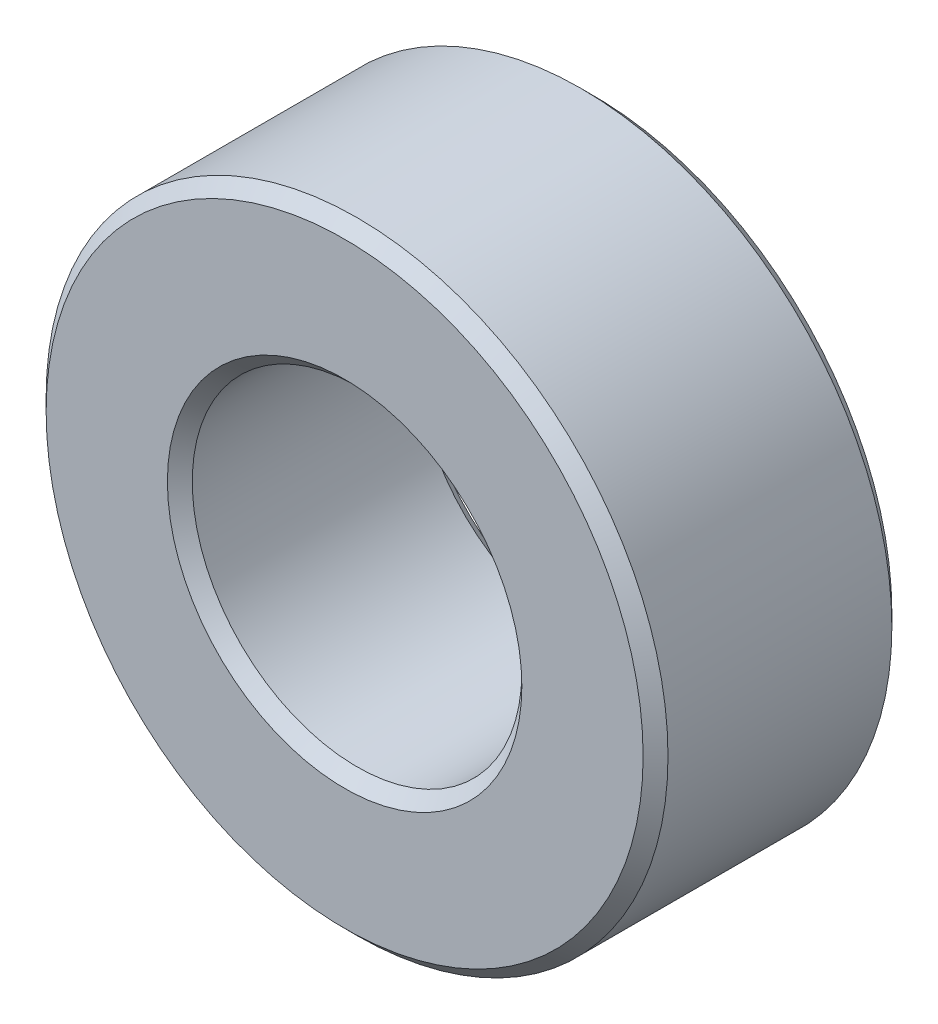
ISO-10303-21;
HEADER;
FILE_DESCRIPTION(('STEP AP214'),'2;1');
FILE_NAME('part.step','',(''),(''),'','','');
FILE_SCHEMA(('AUTOMOTIVE_DESIGN { 1 0 10303 214 1 1 1 1 }'));
ENDSEC;
DATA;
#1=APPLICATION_CONTEXT('core data for automotive mechanical design processes');
#2=APPLICATION_PROTOCOL_DEFINITION('international standard','automotive_design',2000,#1);
#3=PRODUCT_CONTEXT('',#1,'mechanical');
#4=PRODUCT('Part','Part','',(#3));
#5=PRODUCT_RELATED_PRODUCT_CATEGORY('part','',(#4));
#6=PRODUCT_DEFINITION_FORMATION('','',#4);
#7=PRODUCT_DEFINITION_CONTEXT('part definition',#1,'design');
#8=PRODUCT_DEFINITION('design','',#6,#7);
#9=PRODUCT_DEFINITION_SHAPE('','',#8);
#10=(LENGTH_UNIT() NAMED_UNIT(*) SI_UNIT(.MILLI.,.METRE.));
#11=(NAMED_UNIT(*) PLANE_ANGLE_UNIT() SI_UNIT($,.RADIAN.));
#12=(NAMED_UNIT(*) SI_UNIT($,.STERADIAN.) SOLID_ANGLE_UNIT());
#13=UNCERTAINTY_MEASURE_WITH_UNIT(LENGTH_MEASURE(1.E-05),#10,'distance_accuracy_value','');
#14=(GEOMETRIC_REPRESENTATION_CONTEXT(3) GLOBAL_UNCERTAINTY_ASSIGNED_CONTEXT((#13)) GLOBAL_UNIT_ASSIGNED_CONTEXT((#10,
#11,#12)) REPRESENTATION_CONTEXT('',''));
#15=CARTESIAN_POINT('',(0.,0.,0.));
#16=DIRECTION('',(0.,0.,1.));
#17=DIRECTION('',(1.,0.,0.));
#18=AXIS2_PLACEMENT_3D('',#15,#16,#17);
#19=CARTESIAN_POINT('',(0.,0.,2.));
#20=DIRECTION('',(0.,0.,1.));
#21=DIRECTION('',(1.,0.,0.));
#22=AXIS2_PLACEMENT_3D('',#19,#20,#21);
#23=PLANE('',#22);
#24=CARTESIAN_POINT('',(0.,0.,2.));
#25=DIRECTION('',(0.,0.,1.));
#26=DIRECTION('',(1.,0.,0.));
#27=AXIS2_PLACEMENT_3D('',#24,#25,#26);
#28=CIRCLE('',#27,2.85);
#29=CARTESIAN_POINT('',(2.85,0.,2.));
#30=VERTEX_POINT('',#29);
#31=EDGE_CURVE('E10',#30,#30,#28,.F.);
#32=ORIENTED_EDGE('',*,*,#31,.T.);
#33=EDGE_LOOP('',(#32));
#34=FACE_BOUND('',#33,.T.);
#35=CARTESIAN_POINT('',(0.,0.,2.));
#36=DIRECTION('',(0.,0.,1.));
#37=DIRECTION('',(1.,0.,0.));
#38=AXIS2_PLACEMENT_3D('',#35,#36,#37);
#39=CIRCLE('',#38,4.8);
#40=CARTESIAN_POINT('',(4.8,0.,2.));
#41=VERTEX_POINT('',#40);
#42=EDGE_CURVE('E45',#41,#41,#39,.T.);
#43=ORIENTED_EDGE('',*,*,#42,.T.);
#44=EDGE_LOOP('',(#43));
#45=FACE_BOUND('',#44,.T.);
#46=ADVANCED_FACE('F37',(#34,#45),#23,.T.);
#47=CARTESIAN_POINT('',(0.,0.,-2.));
#48=DIRECTION('',(0.,0.,1.));
#49=DIRECTION('',(1.,0.,0.));
#50=AXIS2_PLACEMENT_3D('',#47,#48,#49);
#51=PLANE('',#50);
#52=CARTESIAN_POINT('',(0.,0.,-2.));
#53=DIRECTION('',(0.,0.,1.));
#54=DIRECTION('',(1.,0.,0.));
#55=AXIS2_PLACEMENT_3D('',#52,#53,#54);
#56=CIRCLE('',#55,4.8);
#57=CARTESIAN_POINT('',(4.8,0.,-2.));
#58=VERTEX_POINT('',#57);
#59=EDGE_CURVE('E63',#58,#58,#56,.F.);
#60=ORIENTED_EDGE('',*,*,#59,.T.);
#61=EDGE_LOOP('',(#60));
#62=FACE_BOUND('',#61,.T.);
#63=CARTESIAN_POINT('',(0.,0.,-2.));
#64=DIRECTION('',(0.,0.,1.));
#65=DIRECTION('',(1.,0.,0.));
#66=AXIS2_PLACEMENT_3D('',#63,#64,#65);
#67=CIRCLE('',#66,2.85);
#68=CARTESIAN_POINT('',(2.85,0.,-2.));
#69=VERTEX_POINT('',#68);
#70=EDGE_CURVE('E66',#69,#69,#67,.T.);
#71=ORIENTED_EDGE('',*,*,#70,.T.);
#72=EDGE_LOOP('',(#71));
#73=FACE_BOUND('',#72,.T.);
#74=ADVANCED_FACE('F89',(#62,#73),#51,.F.);
#75=CARTESIAN_POINT('',(0.,0.,2.));
#76=DIRECTION('',(0.,0.,-1.));
#77=DIRECTION('',(-1.,0.,0.));
#78=AXIS2_PLACEMENT_3D('',#75,#76,#77);
#79=CYLINDRICAL_SURFACE('',#78,5.);
#80=CARTESIAN_POINT('',(0.,0.,-1.8));
#81=DIRECTION('',(0.,0.,1.));
#82=DIRECTION('',(1.,0.,0.));
#83=AXIS2_PLACEMENT_3D('',#80,#81,#82);
#84=CIRCLE('',#83,5.);
#85=CARTESIAN_POINT('',(5.,0.,-1.8));
#86=VERTEX_POINT('',#85);
#87=EDGE_CURVE('E69',#86,#86,#84,.T.);
#88=ORIENTED_EDGE('',*,*,#87,.T.);
#89=EDGE_LOOP('',(#88));
#90=FACE_BOUND('',#89,.T.);
#91=CARTESIAN_POINT('',(0.,0.,1.8));
#92=DIRECTION('',(0.,0.,1.));
#93=DIRECTION('',(1.,0.,0.));
#94=AXIS2_PLACEMENT_3D('',#91,#92,#93);
#95=CIRCLE('',#94,5.);
#96=CARTESIAN_POINT('',(5.,0.,1.8));
#97=VERTEX_POINT('',#96);
#98=EDGE_CURVE('E73',#97,#97,#95,.F.);
#99=ORIENTED_EDGE('',*,*,#98,.T.);
#100=EDGE_LOOP('',(#99));
#101=FACE_BOUND('',#100,.T.);
#102=ADVANCED_FACE('F78',(#90,#101),#79,.T.);
#103=CARTESIAN_POINT('',(0.,0.,2.));
#104=DIRECTION('',(0.,0.,-1.));
#105=DIRECTION('',(-1.,0.,0.));
#106=AXIS2_PLACEMENT_3D('',#103,#104,#105);
#107=CYLINDRICAL_SURFACE('',#106,2.65);
#108=CARTESIAN_POINT('',(0.,0.,-1.8));
#109=DIRECTION('',(0.,0.,1.));
#110=DIRECTION('',(1.,0.,0.));
#111=AXIS2_PLACEMENT_3D('',#108,#109,#110);
#112=CIRCLE('',#111,2.65);
#113=CARTESIAN_POINT('',(2.65,0.,-1.8));
#114=VERTEX_POINT('',#113);
#115=EDGE_CURVE('E51',#114,#114,#112,.F.);
#116=ORIENTED_EDGE('',*,*,#115,.T.);
#117=EDGE_LOOP('',(#116));
#118=FACE_BOUND('',#117,.T.);
#119=CARTESIAN_POINT('',(0.,0.,1.8));
#120=DIRECTION('',(0.,0.,1.));
#121=DIRECTION('',(1.,0.,0.));
#122=AXIS2_PLACEMENT_3D('',#119,#120,#121);
#123=CIRCLE('',#122,2.65);
#124=CARTESIAN_POINT('',(2.65,0.,1.8));
#125=VERTEX_POINT('',#124);
#126=EDGE_CURVE('E57',#125,#125,#123,.T.);
#127=ORIENTED_EDGE('',*,*,#126,.T.);
#128=EDGE_LOOP('',(#127));
#129=FACE_BOUND('',#128,.T.);
#130=ADVANCED_FACE('F97',(#118,#129),#107,.F.);
#131=CARTESIAN_POINT('',(0.,0.,-1.8));
#132=DIRECTION('',(0.,0.,1.));
#133=DIRECTION('',(1.,0.,0.));
#134=AXIS2_PLACEMENT_3D('',#131,#132,#133);
#135=CONICAL_SURFACE('',#134,5.,0.785398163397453);
#136=CARTESIAN_POINT('',(4.8,0.,-2.));
#137=CARTESIAN_POINT('',(4.80208333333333,0.,-1.99791666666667));
#138=CARTESIAN_POINT('',(4.80416666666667,0.,-1.99583333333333));
#139=CARTESIAN_POINT('',(4.80833333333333,0.,-1.99166666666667));
#140=CARTESIAN_POINT('',(4.81041666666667,0.,-1.98958333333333));
#141=CARTESIAN_POINT('',(4.81458333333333,0.,-1.98541666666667));
#142=CARTESIAN_POINT('',(4.81666666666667,0.,-1.98333333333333));
#143=CARTESIAN_POINT('',(4.82083333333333,0.,-1.97916666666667));
#144=CARTESIAN_POINT('',(4.82291666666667,0.,-1.97708333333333));
#145=CARTESIAN_POINT('',(4.82708333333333,0.,-1.97291666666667));
#146=CARTESIAN_POINT('',(4.82916666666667,0.,-1.97083333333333));
#147=CARTESIAN_POINT('',(4.83333333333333,0.,-1.96666666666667));
#148=CARTESIAN_POINT('',(4.83541666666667,0.,-1.96458333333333));
#149=CARTESIAN_POINT('',(4.83958333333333,0.,-1.96041666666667));
#150=CARTESIAN_POINT('',(4.84166666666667,0.,-1.95833333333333));
#151=CARTESIAN_POINT('',(4.84583333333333,0.,-1.95416666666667));
#152=CARTESIAN_POINT('',(4.84791666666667,0.,-1.95208333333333));
#153=CARTESIAN_POINT('',(4.85208333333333,0.,-1.94791666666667));
#154=CARTESIAN_POINT('',(4.85416666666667,0.,-1.94583333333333));
#155=CARTESIAN_POINT('',(4.85833333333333,0.,-1.94166666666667));
#156=CARTESIAN_POINT('',(4.86041666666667,0.,-1.93958333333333));
#157=CARTESIAN_POINT('',(4.86458333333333,0.,-1.93541666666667));
#158=CARTESIAN_POINT('',(4.86666666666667,0.,-1.93333333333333));
#159=CARTESIAN_POINT('',(4.87083333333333,0.,-1.92916666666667));
#160=CARTESIAN_POINT('',(4.87291666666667,0.,-1.92708333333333));
#161=CARTESIAN_POINT('',(4.87708333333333,0.,-1.92291666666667));
#162=CARTESIAN_POINT('',(4.87916666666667,0.,-1.92083333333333));
#163=CARTESIAN_POINT('',(4.88333333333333,0.,-1.91666666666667));
#164=CARTESIAN_POINT('',(4.88541666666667,0.,-1.91458333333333));
#165=CARTESIAN_POINT('',(4.88958333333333,0.,-1.91041666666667));
#166=CARTESIAN_POINT('',(4.89166666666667,0.,-1.90833333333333));
#167=CARTESIAN_POINT('',(4.89583333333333,0.,-1.90416666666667));
#168=CARTESIAN_POINT('',(4.89791666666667,0.,-1.90208333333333));
#169=CARTESIAN_POINT('',(4.90208333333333,0.,-1.89791666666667));
#170=CARTESIAN_POINT('',(4.90416666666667,0.,-1.89583333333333));
#171=CARTESIAN_POINT('',(4.90833333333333,0.,-1.89166666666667));
#172=CARTESIAN_POINT('',(4.91041666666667,0.,-1.88958333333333));
#173=CARTESIAN_POINT('',(4.91458333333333,0.,-1.88541666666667));
#174=CARTESIAN_POINT('',(4.91666666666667,0.,-1.88333333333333));
#175=CARTESIAN_POINT('',(4.92083333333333,0.,-1.87916666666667));
#176=CARTESIAN_POINT('',(4.92291666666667,0.,-1.87708333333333));
#177=CARTESIAN_POINT('',(4.92708333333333,0.,-1.87291666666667));
#178=CARTESIAN_POINT('',(4.92916666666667,0.,-1.87083333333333));
#179=CARTESIAN_POINT('',(4.93333333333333,0.,-1.86666666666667));
#180=CARTESIAN_POINT('',(4.93541666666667,0.,-1.86458333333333));
#181=CARTESIAN_POINT('',(4.93958333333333,0.,-1.86041666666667));
#182=CARTESIAN_POINT('',(4.94166666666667,0.,-1.85833333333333));
#183=CARTESIAN_POINT('',(4.94583333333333,0.,-1.85416666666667));
#184=CARTESIAN_POINT('',(4.94791666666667,0.,-1.85208333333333));
#185=CARTESIAN_POINT('',(4.95208333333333,0.,-1.84791666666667));
#186=CARTESIAN_POINT('',(4.95416666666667,0.,-1.84583333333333));
#187=CARTESIAN_POINT('',(4.95833333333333,0.,-1.84166666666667));
#188=CARTESIAN_POINT('',(4.96041666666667,0.,-1.83958333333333));
#189=CARTESIAN_POINT('',(4.96458333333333,0.,-1.83541666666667));
#190=CARTESIAN_POINT('',(4.96666666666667,0.,-1.83333333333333));
#191=CARTESIAN_POINT('',(4.97083333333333,0.,-1.82916666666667));
#192=CARTESIAN_POINT('',(4.97291666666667,0.,-1.82708333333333));
#193=CARTESIAN_POINT('',(4.97708333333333,0.,-1.82291666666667));
#194=CARTESIAN_POINT('',(4.97916666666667,0.,-1.82083333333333));
#195=CARTESIAN_POINT('',(4.98333333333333,0.,-1.81666666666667));
#196=CARTESIAN_POINT('',(4.98541666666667,0.,-1.81458333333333));
#197=CARTESIAN_POINT('',(4.98958333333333,0.,-1.81041666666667));
#198=CARTESIAN_POINT('',(4.99166666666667,0.,-1.80833333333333));
#199=CARTESIAN_POINT('',(4.99583333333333,0.,-1.80416666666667));
#200=CARTESIAN_POINT('',(4.99791666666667,0.,-1.80208333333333));
#201=CARTESIAN_POINT('',(5.,0.,-1.8));
#202=B_SPLINE_CURVE_WITH_KNOTS('',3,(#136,#137,#138,#139,#140,#141,#142,#143,#144,#145,#146,
#147,#148,#149,#150,#151,#152,#153,#154,#155,#156,#157,#158,#159,#160,#161,#162,#163,#164,#165,
#166,#167,#168,#169,#170,#171,#172,#173,#174,#175,#176,#177,#178,#179,#180,#181,#182,#183,#184,
#185,#186,#187,#188,#189,#190,#191,#192,#193,#194,#195,#196,#197,#198,#199,#200,#201),
.UNSPECIFIED.,.F.,.F.,(4,2,2,2,2,2,2,2,2,2,2,2,2,2,2,2,2,2,2,2,2,2,2,2,2,2,2,2,2,2,2,2,4),(0.,
0.00883883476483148,0.0176776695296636,0.0265165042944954,0.0353553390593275,0.0441941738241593,
0.0530330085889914,0.0618718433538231,0.0707106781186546,0.0795495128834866,0.0883883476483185,
0.0972271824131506,0.106066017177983,0.114904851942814,0.123743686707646,0.132582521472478,
0.14142135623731,0.150260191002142,0.159099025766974,0.167937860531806,0.176776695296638,
0.18561553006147,0.194454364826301,0.203293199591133,0.212132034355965,0.220970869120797,
0.229809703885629,0.238648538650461,0.247487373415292,0.256326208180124,0.265165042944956,
0.274003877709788,0.28284271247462),.UNSPECIFIED.);
#203=EDGE_CURVE('BSEAM102',#58,#86,#202,.T.);
#204=ORIENTED_EDGE('',*,*,#59,.F.);
#205=ORIENTED_EDGE('',*,*,#87,.F.);
#206=ORIENTED_EDGE('',*,*,#203,.T.);
#207=ORIENTED_EDGE('',*,*,#203,.F.);
#208=EDGE_LOOP('',(#204,#206,#205,#207));
#209=FACE_BOUND('',#208,.T.);
#210=ADVANCED_FACE('F102',(#209),#135,.T.);
#211=CARTESIAN_POINT('',(0.,0.,-2.));
#212=DIRECTION('',(0.,0.,-1.));
#213=DIRECTION('',(-1.,0.,0.));
#214=AXIS2_PLACEMENT_3D('',#211,#212,#213);
#215=CONICAL_SURFACE('',#214,2.85,0.785398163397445);
#216=ORIENTED_EDGE('',*,*,#115,.F.);
#217=EDGE_LOOP('',(#216));
#218=FACE_BOUND('',#217,.T.);
#219=ORIENTED_EDGE('',*,*,#70,.F.);
#220=EDGE_LOOP('',(#219));
#221=FACE_BOUND('',#220,.T.);
#222=ADVANCED_FACE('F86',(#218,#221),#215,.F.);
#223=CARTESIAN_POINT('',(0.,0.,1.8));
#224=DIRECTION('',(0.,0.,1.));
#225=DIRECTION('',(1.,0.,0.));
#226=AXIS2_PLACEMENT_3D('',#223,#224,#225);
#227=CONICAL_SURFACE('',#226,2.65,0.785398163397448);
#228=ORIENTED_EDGE('',*,*,#31,.F.);
#229=EDGE_LOOP('',(#228));
#230=FACE_BOUND('',#229,.T.);
#231=ORIENTED_EDGE('',*,*,#126,.F.);
#232=EDGE_LOOP('',(#231));
#233=FACE_BOUND('',#232,.T.);
#234=ADVANCED_FACE('F82',(#230,#233),#227,.F.);
#235=CARTESIAN_POINT('',(0.,0.,2.));
#236=DIRECTION('',(0.,0.,-1.));
#237=DIRECTION('',(-1.,0.,0.));
#238=AXIS2_PLACEMENT_3D('',#235,#236,#237);
#239=CONICAL_SURFACE('',#238,4.8,0.785398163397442);
#240=ORIENTED_EDGE('',*,*,#98,.F.);
#241=EDGE_LOOP('',(#240));
#242=FACE_BOUND('',#241,.T.);
#243=ORIENTED_EDGE('',*,*,#42,.F.);
#244=EDGE_LOOP('',(#243));
#245=FACE_BOUND('',#244,.T.);
#246=ADVANCED_FACE('F39',(#242,#245),#239,.T.);
#247=CLOSED_SHELL('',(#46,#74,#102,#130,#210,#222,#234,#246));
#248=MANIFOLD_SOLID_BREP('B2',#247);
#249=ADVANCED_BREP_SHAPE_REPRESENTATION('',(#18,#248),#14);
#250=SHAPE_DEFINITION_REPRESENTATION(#9,#249);
ENDSEC;
END-ISO-10303-21;
